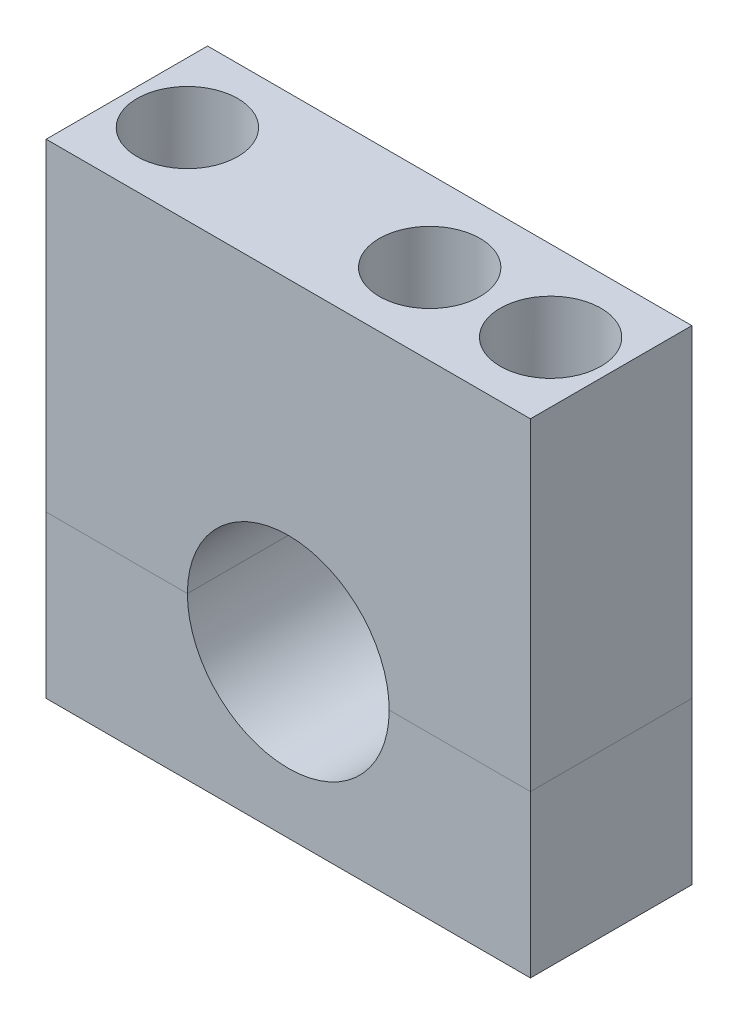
from build123d import *

# Parameters (mm, degrees)
BOSS_EXTRUDE1_DEPTH     = 6.35
BOSS_EXTRUDE2_DEPTH     = 6.35
CUT_EXTRUDE1_DEPTH      = 50.8
CUT_EXTRUDE1_DEPTH_BACK = 15.24
SKETCH5_R               = 2.3876
CUT_EXTRUDE2_START      = 5.08
SKETCH6_R               = 3.9624
CUT_EXTRUDE2_DEPTH      = 27.94
SKETCH7_R               = 3.9624
CUT_EXTRUDE3_DEPTH      = 15.875


with BuildPart() as part:
    # Sketch2 → Boss-Extrude1 (new, symmetric)
    with BuildSketch(Plane.XY):
        with BuildLine():
            Line((-19.05, 0), (-7.9375, 0))
            ThreePointArc((-7.9375, 0), (0, 7.9375), (7.9375, 0))
            Line((7.9375, 0), (19.05, 0))
            Line((19.05, 0), (19.05, 25.4))
            Line((19.05, 25.4), (-19.05, 25.4))
            Line((-19.05, 25.4), (-19.05, 0))
        make_face()
    extrude(amount=BOSS_EXTRUDE1_DEPTH, both=True)


with BuildPart() as body_2:
    # Sketch3 → Boss-Extrude2 (new, symmetric)
    with BuildSketch(Plane.XY):
        with BuildLine():
            Line((-19.05, 0), (-7.9375, 0))
            ThreePointArc((-7.9375, 0), (0, -7.9375), (7.9375, 0))
            Line((7.9375, 0), (19.05, 0))
            Line((19.05, 0), (19.05, -12.7))
            Line((19.05, -12.7), (-19.05, -12.7))
            Line((-19.05, -12.7), (-19.05, 0))
        make_face()
    extrude(amount=BOSS_EXTRUDE2_DEPTH, both=True)


with BuildPart() as cut_extrude1_tool:
    # Sketch5 → Cut-Extrude1 (new, two sides: drawn at the far end of the back side and taken through both)
    with BuildSketch(Plane(origin=(0, 0, 0), x_dir=(1, 0, 0), z_dir=(0, 1, 0)).offset(-CUT_EXTRUDE1_DEPTH_BACK)):
        with Locations((-14.2875, 0)):
            Circle(SKETCH5_R)
        with Locations((14.2875, 0)):
            Circle(SKETCH5_R)
    extrude(amount=CUT_EXTRUDE1_DEPTH + CUT_EXTRUDE1_DEPTH_BACK)


with BuildPart() as part_1:
    add(part.part)

    # Cut-Extrude1: cut by cut_extrude1_tool
    add(cut_extrude1_tool.part, mode=Mode.SUBTRACT)

    # Sketch6 → Cut-Extrude2 (cut)
    with BuildSketch(Plane(origin=(0, 0, 0), x_dir=(1, 0, 0), z_dir=(0, 1, 0)).offset(CUT_EXTRUDE2_START)):
        with Locations((-14.2875, 0)):
            Circle(SKETCH6_R)
        with Locations((14.2875, 0)):
            Circle(SKETCH6_R)
    extrude(amount=CUT_EXTRUDE2_DEPTH, mode=Mode.SUBTRACT)

    # Sketch7 → Cut-Extrude3 (cut)
    with BuildSketch(Plane(origin=(0, 25.4, 0), x_dir=(1, 0, 0), z_dir=(0, 1, 0))):
        with Locations(Location((4.7752, 0, 0), (0, 0, 180))):
            Circle(SKETCH7_R)
    extrude(amount=-CUT_EXTRUDE3_DEPTH, mode=Mode.SUBTRACT)


with BuildPart() as body_2_1:
    add(body_2.part)

    # Cut-Extrude1: cut by cut_extrude1_tool
    add(cut_extrude1_tool.part, mode=Mode.SUBTRACT)


solid = Compound([part_1.part, body_2_1.part])
